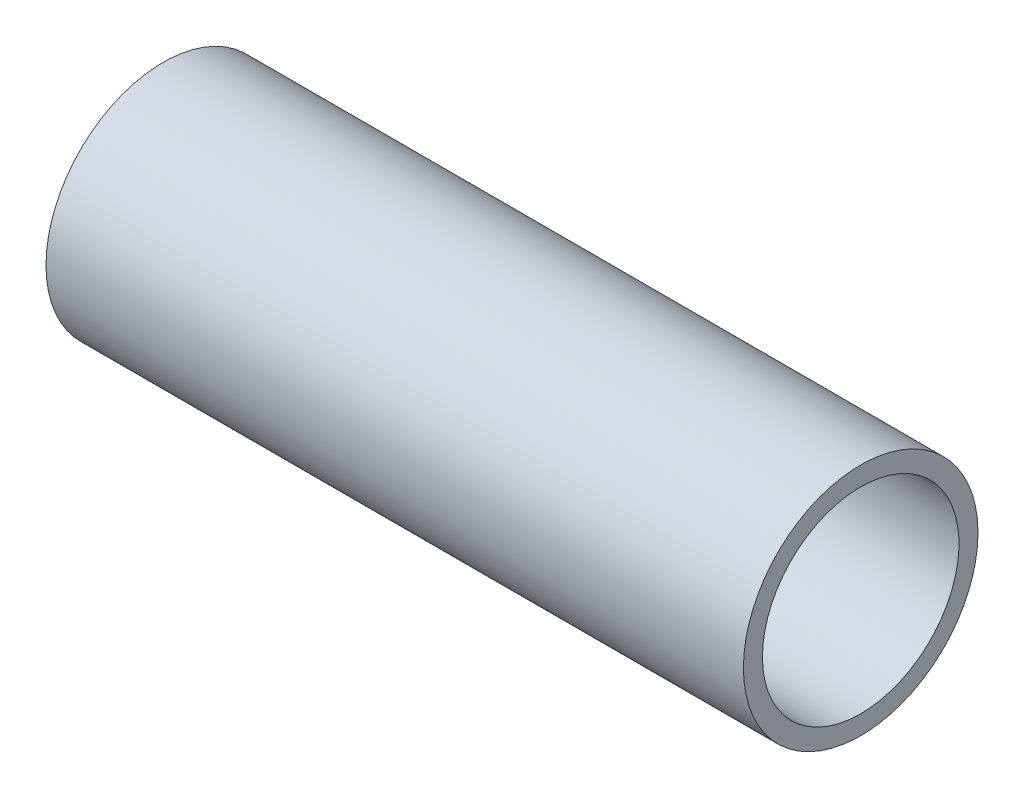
from build123d import *


with BuildPart() as part:
    # Esquisse1 → R_volution1 (revolve)
    with BuildSketch(Plane.XY, mode=Mode.PRIVATE) as r_volution1_sk:
        Polygon((0, 5), (0, 18.5), (110, 18.5), (110, 15.5), (3, 15.5), (3, 5), align=None)
    revolve(r_volution1_sk.sketch.rotate(Axis((0, 0, 0), (1, 0, 0)), 90), axis=Axis((0, 0, 0), (1, 0, 0)))


solid = part.part
